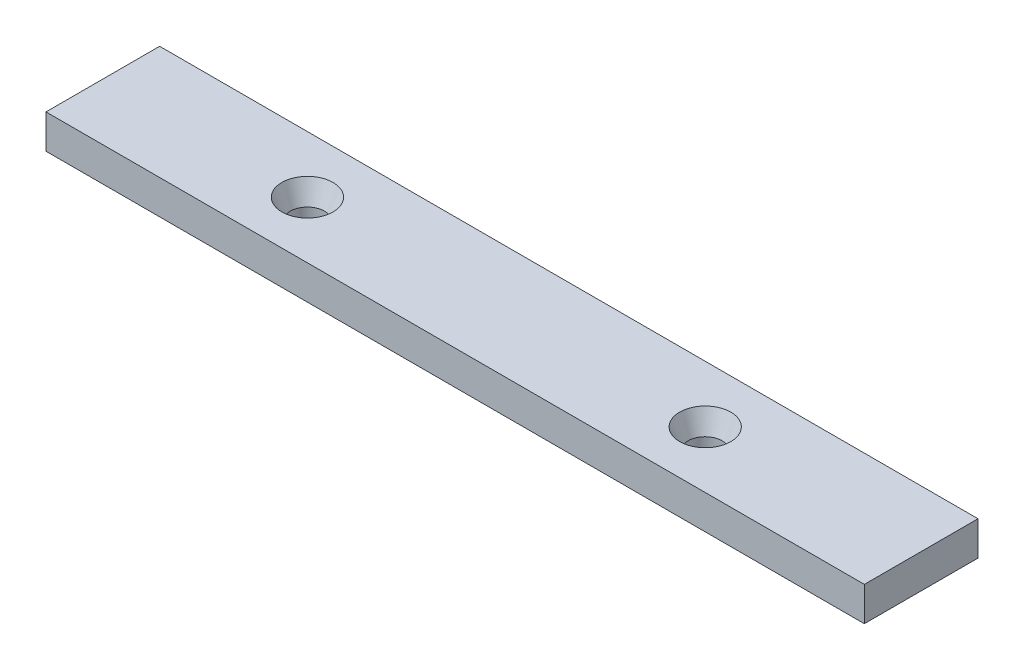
from build123d import *

# Parameters (mm, degrees)
SKETCH1_W                                      = 144
SKETCH1_H                                      = 20
BOSS_EXTRUDE1_DEPTH                            = 6
CSK_FOR_M6_FLAT_HEAD_MACHINE_SCREW1_AT_2_COUNT = 2
CSK_FOR_M6_FLAT_HEAD_MACHINE_SCREW1_AT_2_PITCH = 70


with BuildPart() as part:
    # Sketch1 → Boss-Extrude1 (new body)
    with BuildSketch(Plane(origin=(0, 0, 0), x_dir=(1, 0, 0), z_dir=(0, 1, 0))):
        Rectangle(SKETCH1_W, SKETCH1_H)
    extrude(amount=BOSS_EXTRUDE1_DEPTH)

    # Sketch2 → CSK for M6 Flat Head Machine Screw1 (revolve, cut)
    with BuildSketch(Plane(origin=(-36, 6, 0), x_dir=(0, 0, 1), z_dir=(1, 0, 0))):
        Polygon((0, 0), (0, 6), (3, 6), (3, 3.621320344), (4.5, 0), align=None)
    csk_for_m6_flat_head_machine_screw1 = revolve(axis=Axis((-36, 12.35, 0), (0, -1, 0)), mode=Mode.SUBTRACT)

    # CSK for M6 Flat Head Machine Screw1 at 2: CSK for M6 Flat Head Machine Screw1 ×2
    with Locations(*[(i * CSK_FOR_M6_FLAT_HEAD_MACHINE_SCREW1_AT_2_PITCH, 0, 0) for i in range(1, CSK_FOR_M6_FLAT_HEAD_MACHINE_SCREW1_AT_2_COUNT)]):
        add(csk_for_m6_flat_head_machine_screw1, mode=Mode.SUBTRACT)


solid = part.part
